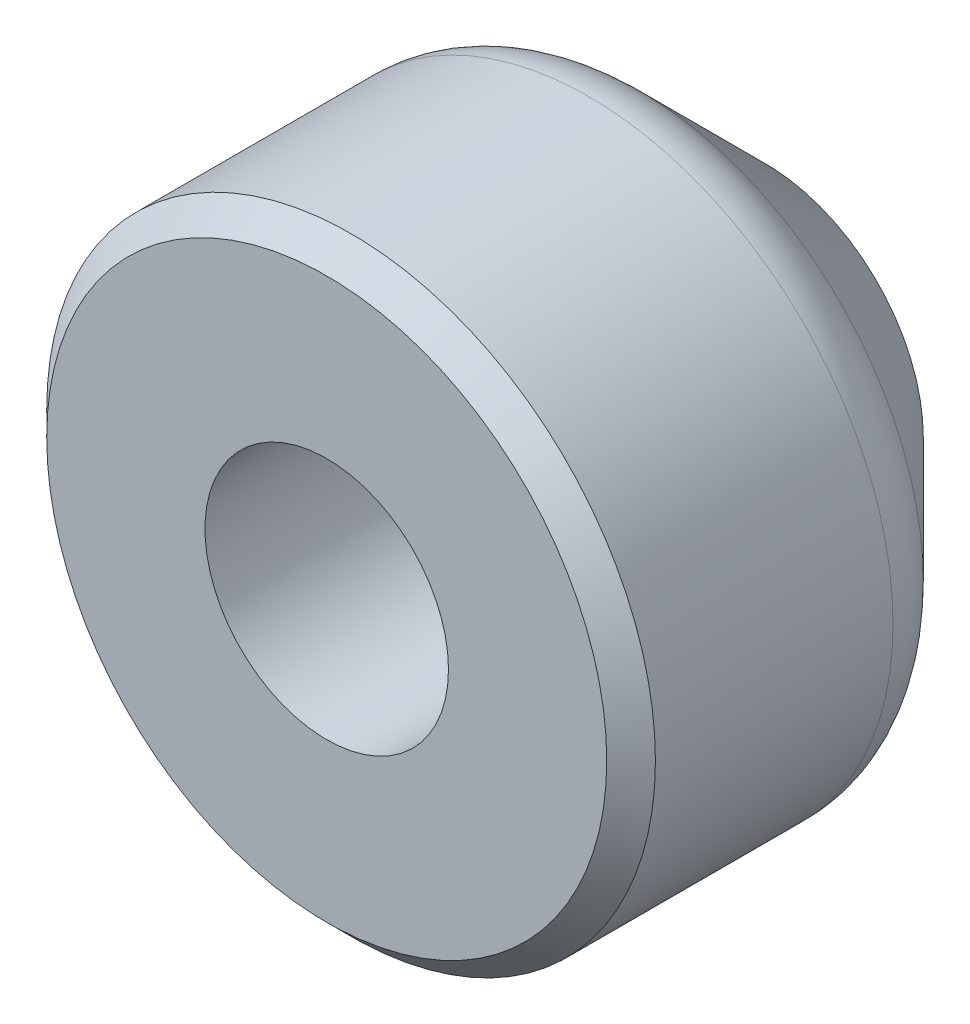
ISO-10303-21;
HEADER;
FILE_DESCRIPTION(('STEP AP214'),'2;1');
FILE_NAME('part.step','',(''),(''),'','','');
FILE_SCHEMA(('AUTOMOTIVE_DESIGN { 1 0 10303 214 1 1 1 1 }'));
ENDSEC;
DATA;
#1=APPLICATION_CONTEXT('core data for automotive mechanical design processes');
#2=APPLICATION_PROTOCOL_DEFINITION('international standard','automotive_design',2000,#1);
#3=PRODUCT_CONTEXT('',#1,'mechanical');
#4=PRODUCT('Part','Part','',(#3));
#5=PRODUCT_RELATED_PRODUCT_CATEGORY('part','',(#4));
#6=PRODUCT_DEFINITION_FORMATION('','',#4);
#7=PRODUCT_DEFINITION_CONTEXT('part definition',#1,'design');
#8=PRODUCT_DEFINITION('design','',#6,#7);
#9=PRODUCT_DEFINITION_SHAPE('','',#8);
#10=(LENGTH_UNIT() NAMED_UNIT(*) SI_UNIT(.MILLI.,.METRE.));
#11=(NAMED_UNIT(*) PLANE_ANGLE_UNIT() SI_UNIT($,.RADIAN.));
#12=(NAMED_UNIT(*) SI_UNIT($,.STERADIAN.) SOLID_ANGLE_UNIT());
#13=UNCERTAINTY_MEASURE_WITH_UNIT(LENGTH_MEASURE(1.E-05),#10,'distance_accuracy_value','');
#14=(GEOMETRIC_REPRESENTATION_CONTEXT(3) GLOBAL_UNCERTAINTY_ASSIGNED_CONTEXT((#13)) GLOBAL_UNIT_ASSIGNED_CONTEXT((#10,
#11,#12)) REPRESENTATION_CONTEXT('',''));
#15=CARTESIAN_POINT('',(0.,0.,0.));
#16=DIRECTION('',(0.,0.,1.));
#17=DIRECTION('',(1.,0.,0.));
#18=AXIS2_PLACEMENT_3D('',#15,#16,#17);
#19=CARTESIAN_POINT('',(0.,-5.,18.));
#20=DIRECTION('',(0.,0.,1.));
#21=DIRECTION('',(1.,0.,0.));
#22=AXIS2_PLACEMENT_3D('',#19,#20,#21);
#23=PLANE('',#22);
#24=CARTESIAN_POINT('',(0.,0.,18.));
#25=DIRECTION('',(0.,0.,1.));
#26=DIRECTION('',(1.,0.,0.));
#27=AXIS2_PLACEMENT_3D('',#24,#25,#26);
#28=CIRCLE('',#27,11.5);
#29=CARTESIAN_POINT('',(11.5,0.,18.));
#30=VERTEX_POINT('',#29);
#31=EDGE_CURVE('E8',#30,#30,#28,.T.);
#32=ORIENTED_EDGE('',*,*,#31,.T.);
#33=EDGE_LOOP('',(#32));
#34=FACE_BOUND('',#33,.T.);
#35=CARTESIAN_POINT('',(0.,0.,18.));
#36=DIRECTION('',(0.,0.,1.));
#37=DIRECTION('',(1.,0.,0.));
#38=AXIS2_PLACEMENT_3D('',#35,#36,#37);
#39=CIRCLE('',#38,5.);
#40=CARTESIAN_POINT('',(5.,0.,18.));
#41=VERTEX_POINT('',#40);
#42=EDGE_CURVE('E37',#41,#41,#39,.T.);
#43=ORIENTED_EDGE('',*,*,#42,.F.);
#44=EDGE_LOOP('',(#43));
#45=FACE_BOUND('',#44,.T.);
#46=ADVANCED_FACE('F12',(#34,#45),#23,.T.);
#47=CARTESIAN_POINT('',(0.,0.,17.));
#48=DIRECTION('',(0.,0.,-1.));
#49=DIRECTION('',(-1.,0.,0.));
#50=AXIS2_PLACEMENT_3D('',#47,#48,#49);
#51=CONICAL_SURFACE('',#50,12.5,0.785398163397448);
#52=ORIENTED_EDGE('',*,*,#31,.F.);
#53=EDGE_LOOP('',(#52));
#54=FACE_BOUND('',#53,.T.);
#55=CARTESIAN_POINT('',(0.,0.,17.));
#56=DIRECTION('',(0.,0.,1.));
#57=DIRECTION('',(1.,0.,0.));
#58=AXIS2_PLACEMENT_3D('',#55,#56,#57);
#59=CIRCLE('',#58,12.5);
#60=CARTESIAN_POINT('',(12.5,0.,17.));
#61=VERTEX_POINT('',#60);
#62=EDGE_CURVE('E18',#61,#61,#59,.T.);
#63=ORIENTED_EDGE('',*,*,#62,.T.);
#64=EDGE_LOOP('',(#63));
#65=FACE_BOUND('',#64,.T.);
#66=ADVANCED_FACE('F44',(#54,#65),#51,.T.);
#67=CARTESIAN_POINT('',(0.,0.,24.2022085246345));
#68=DIRECTION('',(0.,0.,1.));
#69=DIRECTION('',(1.,0.,0.));
#70=AXIS2_PLACEMENT_3D('',#67,#68,#69);
#71=CYLINDRICAL_SURFACE('',#70,12.5);
#72=CARTESIAN_POINT('',(0.,0.,7.24264068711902));
#73=DIRECTION('',(0.,0.,1.));
#74=DIRECTION('',(1.,0.,0.));
#75=AXIS2_PLACEMENT_3D('',#72,#73,#74);
#76=CIRCLE('',#75,12.5);
#77=CARTESIAN_POINT('',(12.5,0.,7.24264068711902));
#78=VERTEX_POINT('',#77);
#79=EDGE_CURVE('E22',#78,#78,#76,.T.);
#80=ORIENTED_EDGE('',*,*,#79,.T.);
#81=EDGE_LOOP('',(#80));
#82=FACE_BOUND('',#81,.T.);
#83=ORIENTED_EDGE('',*,*,#62,.F.);
#84=EDGE_LOOP('',(#83));
#85=FACE_BOUND('',#84,.T.);
#86=ADVANCED_FACE('F50',(#82,#85),#71,.T.);
#87=CARTESIAN_POINT('',(0.,0.,7.24264068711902));
#88=DIRECTION('',(0.,0.,1.));
#89=DIRECTION('',(1.,0.,0.));
#90=AXIS2_PLACEMENT_3D('',#87,#88,#89);
#91=TOROIDAL_SURFACE('',#90,9.5,3.);
#92=CARTESIAN_POINT('',(0.,0.,5.1213203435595));
#93=DIRECTION('',(0.,0.,1.));
#94=DIRECTION('',(1.,0.,0.));
#95=AXIS2_PLACEMENT_3D('',#92,#93,#94);
#96=CIRCLE('',#95,11.6213203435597);
#97=CARTESIAN_POINT('',(11.6213203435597,0.,5.1213203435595));
#98=VERTEX_POINT('',#97);
#99=EDGE_CURVE('E26',#98,#98,#96,.T.);
#100=ORIENTED_EDGE('',*,*,#99,.T.);
#101=EDGE_LOOP('',(#100));
#102=FACE_BOUND('',#101,.T.);
#103=ORIENTED_EDGE('',*,*,#79,.F.);
#104=EDGE_LOOP('',(#103));
#105=FACE_BOUND('',#104,.T.);
#106=ADVANCED_FACE('F56',(#102,#105),#91,.T.);
#107=CARTESIAN_POINT('',(0.,0.,5.1213203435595));
#108=DIRECTION('',(0.,0.,1.));
#109=DIRECTION('',(1.,0.,0.));
#110=AXIS2_PLACEMENT_3D('',#107,#108,#109);
#111=CONICAL_SURFACE('',#110,11.6213203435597,0.785398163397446);
#112=CARTESIAN_POINT('',(0.,0.,0.));
#113=DIRECTION('',(0.,0.,1.));
#114=DIRECTION('',(1.,0.,0.));
#115=AXIS2_PLACEMENT_3D('',#112,#113,#114);
#116=CIRCLE('',#115,6.5);
#117=CARTESIAN_POINT('',(6.5,0.,0.));
#118=VERTEX_POINT('',#117);
#119=EDGE_CURVE('E31',#118,#118,#116,.T.);
#120=ORIENTED_EDGE('',*,*,#119,.T.);
#121=EDGE_LOOP('',(#120));
#122=FACE_BOUND('',#121,.T.);
#123=ORIENTED_EDGE('',*,*,#99,.F.);
#124=EDGE_LOOP('',(#123));
#125=FACE_BOUND('',#124,.T.);
#126=ADVANCED_FACE('F62',(#122,#125),#111,.T.);
#127=CARTESIAN_POINT('',(0.,-6.5,0.));
#128=DIRECTION('',(0.,0.,-1.));
#129=DIRECTION('',(-1.,0.,0.));
#130=AXIS2_PLACEMENT_3D('',#127,#128,#129);
#131=PLANE('',#130);
#132=CARTESIAN_POINT('',(0.,0.,0.));
#133=DIRECTION('',(0.,0.,1.));
#134=DIRECTION('',(1.,0.,0.));
#135=AXIS2_PLACEMENT_3D('',#132,#133,#134);
#136=CIRCLE('',#135,5.);
#137=CARTESIAN_POINT('',(5.,0.,0.));
#138=VERTEX_POINT('',#137);
#139=EDGE_CURVE('E34',#138,#138,#136,.T.);
#140=ORIENTED_EDGE('',*,*,#139,.T.);
#141=EDGE_LOOP('',(#140));
#142=FACE_BOUND('',#141,.T.);
#143=ORIENTED_EDGE('',*,*,#119,.F.);
#144=EDGE_LOOP('',(#143));
#145=FACE_BOUND('',#144,.T.);
#146=ADVANCED_FACE('F66',(#142,#145),#131,.T.);
#147=CARTESIAN_POINT('',(0.,0.,24.2022085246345));
#148=DIRECTION('',(0.,0.,1.));
#149=DIRECTION('',(1.,0.,0.));
#150=AXIS2_PLACEMENT_3D('',#147,#148,#149);
#151=CYLINDRICAL_SURFACE('',#150,5.);
#152=ORIENTED_EDGE('',*,*,#139,.F.);
#153=EDGE_LOOP('',(#152));
#154=FACE_BOUND('',#153,.T.);
#155=ORIENTED_EDGE('',*,*,#42,.T.);
#156=EDGE_LOOP('',(#155));
#157=FACE_BOUND('',#156,.T.);
#158=ADVANCED_FACE('F41',(#154,#157),#151,.F.);
#159=CLOSED_SHELL('',(#46,#66,#86,#106,#126,#146,#158));
#160=MANIFOLD_SOLID_BREP('B1',#159);
#161=ADVANCED_BREP_SHAPE_REPRESENTATION('',(#18,#160),#14);
#162=SHAPE_DEFINITION_REPRESENTATION(#9,#161);
ENDSEC;
END-ISO-10303-21;
